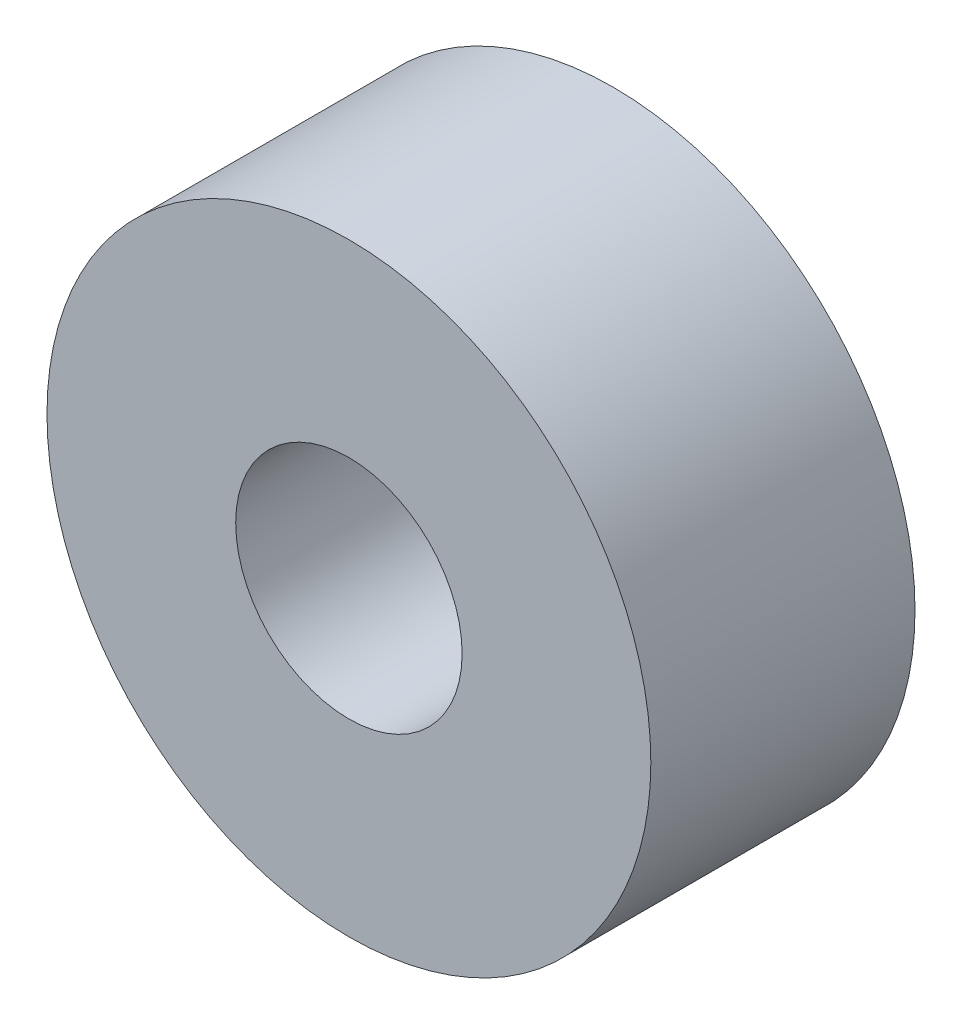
from build123d import *

# Parameters (mm, degrees)
ESQUISSE1_R        = 4
ESQUISSE1_R_2      = 1.5
BOSS_EXTRU_1_DEPTH = 3.5


with BuildPart() as part:
    # Esquisse1 → Boss.-Extru.1 (new body)
    with BuildSketch(Plane.XY):
        Circle(ESQUISSE1_R)
        Circle(ESQUISSE1_R_2, mode=Mode.SUBTRACT)
    extrude(amount=-BOSS_EXTRU_1_DEPTH)


solid = part.part
